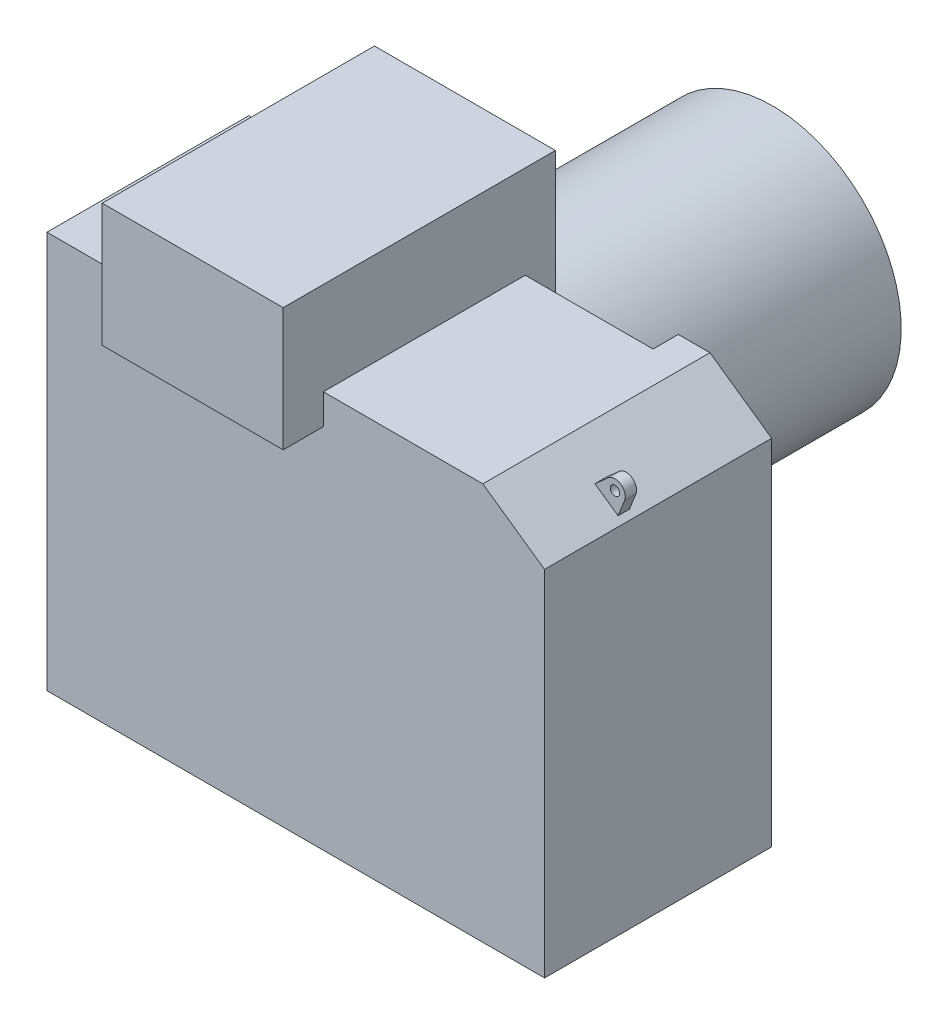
ISO-10303-21;
HEADER;
FILE_DESCRIPTION(('STEP AP214'),'2;1');
FILE_NAME('part.step','',(''),(''),'','','');
FILE_SCHEMA(('AUTOMOTIVE_DESIGN { 1 0 10303 214 1 1 1 1 }'));
ENDSEC;
DATA;
#1=APPLICATION_CONTEXT('core data for automotive mechanical design processes');
#2=APPLICATION_PROTOCOL_DEFINITION('international standard','automotive_design',2000,#1);
#3=PRODUCT_CONTEXT('',#1,'mechanical');
#4=PRODUCT('Part','Part','',(#3));
#5=PRODUCT_RELATED_PRODUCT_CATEGORY('part','',(#4));
#6=PRODUCT_DEFINITION_FORMATION('','',#4);
#7=PRODUCT_DEFINITION_CONTEXT('part definition',#1,'design');
#8=PRODUCT_DEFINITION('design','',#6,#7);
#9=PRODUCT_DEFINITION_SHAPE('','',#8);
#10=(LENGTH_UNIT() NAMED_UNIT(*) SI_UNIT(.MILLI.,.METRE.));
#11=(NAMED_UNIT(*) PLANE_ANGLE_UNIT() SI_UNIT($,.RADIAN.));
#12=(NAMED_UNIT(*) SI_UNIT($,.STERADIAN.) SOLID_ANGLE_UNIT());
#13=UNCERTAINTY_MEASURE_WITH_UNIT(LENGTH_MEASURE(1.E-05),#10,'distance_accuracy_value','');
#14=(GEOMETRIC_REPRESENTATION_CONTEXT(3) GLOBAL_UNCERTAINTY_ASSIGNED_CONTEXT((#13)) GLOBAL_UNIT_ASSIGNED_CONTEXT((#10,
#11,#12)) REPRESENTATION_CONTEXT('',''));
#15=CARTESIAN_POINT('',(0.,0.,0.));
#16=DIRECTION('',(0.,0.,1.));
#17=DIRECTION('',(1.,0.,0.));
#18=AXIS2_PLACEMENT_3D('',#15,#16,#17);
#19=CARTESIAN_POINT('',(-58.7375,115.8875,-25.654));
#20=DIRECTION('',(0.,0.,1.));
#21=DIRECTION('',(1.,0.,0.));
#22=AXIS2_PLACEMENT_3D('',#19,#20,#21);
#23=PLANE('',#22);
#24=CARTESIAN_POINT('',(0.,63.5,-25.654));
#25=DIRECTION('',(0.,0.,-1.));
#26=DIRECTION('',(-1.,0.,0.));
#27=AXIS2_PLACEMENT_3D('',#24,#25,#26);
#28=CIRCLE('',#27,40.64);
#29=CARTESIAN_POINT('',(-17.8450817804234,26.9875,-25.654));
#30=VERTEX_POINT('',#29);
#31=CARTESIAN_POINT('',(17.8450817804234,26.9875,-25.654));
#32=VERTEX_POINT('',#31);
#33=EDGE_CURVE('E54',#30,#32,#28,.T.);
#34=ORIENTED_EDGE('',*,*,#33,.F.);
#35=DIRECTION('',(-1.,0.,0.));
#36=VECTOR('',#35,1.);
#37=CARTESIAN_POINT('',(-58.7375,26.9875,-25.654));
#38=LINE('',#37,#36);
#39=CARTESIAN_POINT('',(-58.7375,26.9875,-25.654));
#40=VERTEX_POINT('',#39);
#41=EDGE_CURVE('E41',#30,#40,#38,.T.);
#42=ORIENTED_EDGE('',*,*,#41,.T.);
#43=DIRECTION('',(0.,-1.,0.));
#44=VECTOR('',#43,1.);
#45=CARTESIAN_POINT('',(-58.7375,115.8875,-25.654));
#46=LINE('',#45,#44);
#47=CARTESIAN_POINT('',(-58.7375,125.4125,-25.654));
#48=VERTEX_POINT('',#47);
#49=EDGE_CURVE('E403',#48,#40,#46,.T.);
#50=ORIENTED_EDGE('',*,*,#49,.F.);
#51=DIRECTION('',(-1.,0.,0.));
#52=VECTOR('',#51,1.);
#53=CARTESIAN_POINT('',(-28.575,125.4125,-25.654));
#54=LINE('',#53,#52);
#55=CARTESIAN_POINT('',(-28.575,125.4125,-25.654));
#56=VERTEX_POINT('',#55);
#57=EDGE_CURVE('E359',#56,#48,#54,.T.);
#58=ORIENTED_EDGE('',*,*,#57,.F.);
#59=DIRECTION('',(0.,-1.,0.));
#60=VECTOR('',#59,1.);
#61=CARTESIAN_POINT('',(-28.575,125.4125,-25.654));
#62=LINE('',#61,#60);
#63=CARTESIAN_POINT('',(-28.575,115.8875,-25.654));
#64=VERTEX_POINT('',#63);
#65=EDGE_CURVE('E378',#56,#64,#62,.T.);
#66=ORIENTED_EDGE('',*,*,#65,.T.);
#67=DIRECTION('',(-1.,0.,0.));
#68=VECTOR('',#67,1.);
#69=CARTESIAN_POINT('',(-58.7375,115.8875,-25.654));
#70=LINE('',#69,#68);
#71=CARTESIAN_POINT('',(28.575,115.8875,-25.654));
#72=VERTEX_POINT('',#71);
#73=EDGE_CURVE('E398',#72,#64,#70,.T.);
#74=ORIENTED_EDGE('',*,*,#73,.F.);
#75=DIRECTION('',(0.,-1.,0.));
#76=VECTOR('',#75,1.);
#77=CARTESIAN_POINT('',(28.575,125.4125,-25.654));
#78=LINE('',#77,#76);
#79=CARTESIAN_POINT('',(28.575,125.4125,-25.654));
#80=VERTEX_POINT('',#79);
#81=EDGE_CURVE('E381',#80,#72,#78,.T.);
#82=ORIENTED_EDGE('',*,*,#81,.F.);
#83=DIRECTION('',(-1.,0.,0.));
#84=VECTOR('',#83,1.);
#85=CARTESIAN_POINT('',(68.9397527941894,125.4125,-25.654));
#86=LINE('',#85,#84);
#87=CARTESIAN_POINT('',(68.9397527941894,125.4125,-25.654));
#88=VERTEX_POINT('',#87);
#89=EDGE_CURVE('E366',#88,#80,#86,.T.);
#90=ORIENTED_EDGE('',*,*,#89,.F.);
#91=DIRECTION('',(0.,-1.,0.));
#92=VECTOR('',#91,1.);
#93=CARTESIAN_POINT('',(68.9397527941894,115.8875,-25.654));
#94=LINE('',#93,#92);
#95=CARTESIAN_POINT('',(68.9397527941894,26.9875,-25.654));
#96=VERTEX_POINT('',#95);
#97=EDGE_CURVE('E531',#88,#96,#94,.T.);
#98=ORIENTED_EDGE('',*,*,#97,.T.);
#99=CARTESIAN_POINT('',(57.15,26.9875,-25.654));
#100=VERTEX_POINT('',#99);
#101=EDGE_CURVE('E399',#96,#100,#38,.T.);
#102=ORIENTED_EDGE('',*,*,#101,.T.);
#103=EDGE_CURVE('E483',#100,#32,#38,.T.);
#104=ORIENTED_EDGE('',*,*,#103,.T.);
#105=EDGE_LOOP('',(#34,#42,#50,#58,#66,#74,#82,#90,#98,#102,#104));
#106=FACE_BOUND('',#105,.T.);
#107=ADVANCED_FACE('F37',(#106),#23,.F.);
#108=CARTESIAN_POINT('',(57.15,26.9875,-38.354));
#109=DIRECTION('',(0.,1.,0.));
#110=DIRECTION('',(0.,0.,1.));
#111=AXIS2_PLACEMENT_3D('',#108,#109,#110);
#112=PLANE('',#111);
#113=ORIENTED_EDGE('',*,*,#41,.F.);
#114=DIRECTION('',(0.,0.,1.));
#115=VECTOR('',#114,1.);
#116=CARTESIAN_POINT('',(-17.8450817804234,26.9875,-132.334));
#117=LINE('',#116,#115);
#118=CARTESIAN_POINT('',(-17.8450817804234,26.9875,-34.13125));
#119=VERTEX_POINT('',#118);
#120=EDGE_CURVE('E246',#30,#119,#117,.F.);
#121=ORIENTED_EDGE('',*,*,#120,.T.);
#122=DIRECTION('',(-1.,0.,0.));
#123=VECTOR('',#122,1.);
#124=CARTESIAN_POINT('',(-58.7375,26.9875,-34.13125));
#125=LINE('',#124,#123);
#126=CARTESIAN_POINT('',(-58.7375,26.9875,-34.13125));
#127=VERTEX_POINT('',#126);
#128=EDGE_CURVE('E233',#119,#127,#125,.T.);
#129=ORIENTED_EDGE('',*,*,#128,.T.);
#130=DIRECTION('',(0.,0.,1.));
#131=VECTOR('',#130,1.);
#132=CARTESIAN_POINT('',(-58.7375,26.9875,38.1));
#133=LINE('',#132,#131);
#134=EDGE_CURVE('E479',#127,#40,#133,.T.);
#135=ORIENTED_EDGE('',*,*,#134,.T.);
#136=EDGE_LOOP('',(#113,#121,#129,#135));
#137=FACE_BOUND('',#136,.T.);
#138=ADVANCED_FACE('F247',(#137),#112,.T.);
#139=CARTESIAN_POINT('',(39.0501582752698,26.9875,-34.13125));
#140=VERTEX_POINT('',#139);
#141=CARTESIAN_POINT('',(17.8450817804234,26.9875,-34.13125));
#142=VERTEX_POINT('',#141);
#143=EDGE_CURVE('E242',#140,#142,#125,.T.);
#144=ORIENTED_EDGE('',*,*,#143,.T.);
#145=DIRECTION('',(0.,0.,1.));
#146=VECTOR('',#145,1.);
#147=CARTESIAN_POINT('',(17.8450817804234,26.9875,-132.334));
#148=LINE('',#147,#146);
#149=EDGE_CURVE('E62',#142,#32,#148,.T.);
#150=ORIENTED_EDGE('',*,*,#149,.T.);
#151=ORIENTED_EDGE('',*,*,#103,.F.);
#152=CARTESIAN_POINT('',(57.15,26.9875,-38.354));
#153=DIRECTION('',(0.,-1.,0.));
#154=DIRECTION('',(0.,0.,1.));
#155=AXIS2_PLACEMENT_3D('',#152,#153,#154);
#156=CIRCLE('',#155,12.7);
#157=CARTESIAN_POINT('',(50.8056186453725,26.9875,-27.3522353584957));
#158=VERTEX_POINT('',#157);
#159=EDGE_CURVE('E502',#100,#158,#156,.T.);
#160=ORIENTED_EDGE('',*,*,#159,.T.);
#161=DIRECTION('',(-0.86628068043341,0.,-0.499557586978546));
#162=VECTOR('',#161,1.);
#163=CARTESIAN_POINT('',(50.8056186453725,26.9875,-27.3522353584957));
#164=LINE('',#163,#162);
#165=EDGE_CURVE('E243',#158,#140,#164,.T.);
#166=ORIENTED_EDGE('',*,*,#165,.T.);
#167=EDGE_LOOP('',(#144,#150,#151,#160,#166));
#168=FACE_BOUND('',#167,.T.);
#169=ADVANCED_FACE('F548',(#168),#112,.T.);
#170=CARTESIAN_POINT('',(-58.7375,26.9875,-34.13125));
#171=DIRECTION('',(0.,0.,1.));
#172=DIRECTION('',(1.,0.,0.));
#173=AXIS2_PLACEMENT_3D('',#170,#171,#172);
#174=PLANE('',#173);
#175=CARTESIAN_POINT('',(0.,63.5,-34.13125));
#176=DIRECTION('',(0.,0.,1.));
#177=DIRECTION('',(1.,0.,0.));
#178=AXIS2_PLACEMENT_3D('',#175,#176,#177);
#179=CIRCLE('',#178,40.64);
#180=EDGE_CURVE('E11',#142,#119,#179,.F.);
#181=ORIENTED_EDGE('',*,*,#180,.F.);
#182=ORIENTED_EDGE('',*,*,#143,.F.);
#183=DIRECTION('',(0.,-1.,0.));
#184=VECTOR('',#183,1.);
#185=CARTESIAN_POINT('',(39.0501582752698,26.9875,-34.13125));
#186=LINE('',#185,#184);
#187=CARTESIAN_POINT('',(39.0501582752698,0.,-34.13125));
#188=VERTEX_POINT('',#187);
#189=EDGE_CURVE('E506',#140,#188,#186,.T.);
#190=ORIENTED_EDGE('',*,*,#189,.T.);
#191=DIRECTION('',(-1.,0.,0.));
#192=VECTOR('',#191,1.);
#193=CARTESIAN_POINT('',(-58.7375,0.,-34.13125));
#194=LINE('',#193,#192);
#195=CARTESIAN_POINT('',(-58.7375,0.,-34.13125));
#196=VERTEX_POINT('',#195);
#197=EDGE_CURVE('E498',#188,#196,#194,.T.);
#198=ORIENTED_EDGE('',*,*,#197,.T.);
#199=DIRECTION('',(0.,-1.,0.));
#200=VECTOR('',#199,1.);
#201=CARTESIAN_POINT('',(-58.7375,26.9875,-34.13125));
#202=LINE('',#201,#200);
#203=EDGE_CURVE('E238',#127,#196,#202,.T.);
#204=ORIENTED_EDGE('',*,*,#203,.F.);
#205=ORIENTED_EDGE('',*,*,#128,.F.);
#206=EDGE_LOOP('',(#181,#182,#190,#198,#204,#205));
#207=FACE_BOUND('',#206,.T.);
#208=ADVANCED_FACE('F235',(#207),#174,.F.);
#209=CARTESIAN_POINT('',(69.0224585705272,132.34788115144,-76.454));
#210=DIRECTION('',(-0.573576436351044,-0.819152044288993,0.));
#211=DIRECTION('',(0.819152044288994,-0.573576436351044,0.));
#212=AXIS2_PLACEMENT_3D('',#209,#210,#211);
#213=PLANE('',#212);
#214=DIRECTION('',(0.,0.,1.));
#215=VECTOR('',#214,1.);
#216=CARTESIAN_POINT('',(78.9272093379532,125.4125,-25.654));
#217=LINE('',#216,#215);
#218=CARTESIAN_POINT('',(78.9272093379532,125.4125,-33.6325882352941));
#219=VERTEX_POINT('',#218);
#220=CARTESIAN_POINT('',(78.9272093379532,125.4125,38.1));
#221=VERTEX_POINT('',#220);
#222=EDGE_CURVE('E302',#219,#221,#217,.T.);
#223=ORIENTED_EDGE('',*,*,#222,.T.);
#224=DIRECTION('',(-0.819152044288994,0.573576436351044,0.));
#225=VECTOR('',#224,1.);
#226=CARTESIAN_POINT('',(138.255046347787,83.8707013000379,38.1));
#227=LINE('',#226,#225);
#228=CARTESIAN_POINT('',(98.425,111.76,38.1));
#229=VERTEX_POINT('',#228);
#230=EDGE_CURVE('E299',#229,#221,#227,.T.);
#231=ORIENTED_EDGE('',*,*,#230,.F.);
#232=DIRECTION('',(0.,0.,1.));
#233=VECTOR('',#232,1.);
#234=CARTESIAN_POINT('',(98.425,111.76,-33.6325882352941));
#235=LINE('',#234,#233);
#236=CARTESIAN_POINT('',(98.425,111.76,-33.6325882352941));
#237=VERTEX_POINT('',#236);
#238=EDGE_CURVE('E296',#237,#229,#235,.T.);
#239=ORIENTED_EDGE('',*,*,#238,.F.);
#240=DIRECTION('',(0.819152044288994,-0.573576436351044,0.));
#241=VECTOR('',#240,1.);
#242=CARTESIAN_POINT('',(118.470148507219,97.7242359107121,-33.6325882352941));
#243=LINE('',#242,#241);
#244=EDGE_CURVE('E47',#219,#237,#243,.T.);
#245=ORIENTED_EDGE('',*,*,#244,.F.);
#246=EDGE_LOOP('',(#223,#231,#239,#245));
#247=FACE_BOUND('',#246,.T.);
#248=DIRECTION('',(0.,0.,-1.));
#249=VECTOR('',#248,1.);
#250=CARTESIAN_POINT('',(89.3229765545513,118.133305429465,13.081));
#251=LINE('',#250,#249);
#252=CARTESIAN_POINT('',(89.3229765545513,118.133305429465,13.081));
#253=VERTEX_POINT('',#252);
#254=CARTESIAN_POINT('',(89.3229765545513,118.133305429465,9.52500000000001));
#255=VERTEX_POINT('',#254);
#256=EDGE_CURVE('E291',#253,#255,#251,.T.);
#257=ORIENTED_EDGE('',*,*,#256,.T.);
#258=DIRECTION('',(0.819152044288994,-0.573576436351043,0.));
#259=VECTOR('',#258,1.);
#260=CARTESIAN_POINT('',(96.6243089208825,113.020857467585,9.525));
#261=LINE('',#260,#259);
#262=CARTESIAN_POINT('',(96.6243089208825,113.020857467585,9.525));
#263=VERTEX_POINT('',#262);
#264=EDGE_CURVE('E283',#255,#263,#261,.T.);
#265=ORIENTED_EDGE('',*,*,#264,.T.);
#266=DIRECTION('',(0.,0.,-1.));
#267=VECTOR('',#266,1.);
#268=CARTESIAN_POINT('',(96.6243089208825,113.020857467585,13.081));
#269=LINE('',#268,#267);
#270=CARTESIAN_POINT('',(96.6243089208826,113.020857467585,13.081));
#271=VERTEX_POINT('',#270);
#272=EDGE_CURVE('E288',#271,#263,#269,.T.);
#273=ORIENTED_EDGE('',*,*,#272,.F.);
#274=DIRECTION('',(0.819152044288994,-0.573576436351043,0.));
#275=VECTOR('',#274,1.);
#276=CARTESIAN_POINT('',(96.6243089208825,113.020857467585,13.081));
#277=LINE('',#276,#275);
#278=EDGE_CURVE('E272',#253,#271,#277,.T.);
#279=ORIENTED_EDGE('',*,*,#278,.F.);
#280=EDGE_LOOP('',(#257,#265,#273,#279));
#281=FACE_BOUND('',#280,.T.);
#282=ADVANCED_FACE('F596',(#247,#281),#213,.F.);
#283=CARTESIAN_POINT('',(-58.7375,26.9875,38.1));
#284=DIRECTION('',(1.,0.,0.));
#285=DIRECTION('',(0.,0.,-1.));
#286=AXIS2_PLACEMENT_3D('',#283,#284,#285);
#287=PLANE('',#286);
#288=DIRECTION('',(0.,0.,1.));
#289=VECTOR('',#288,1.);
#290=CARTESIAN_POINT('',(-58.7375,0.,38.1));
#291=LINE('',#290,#289);
#292=CARTESIAN_POINT('',(-58.7375,0.,38.1));
#293=VERTEX_POINT('',#292);
#294=EDGE_CURVE('E500',#196,#293,#291,.T.);
#295=ORIENTED_EDGE('',*,*,#294,.T.);
#296=DIRECTION('',(0.,-1.,0.));
#297=VECTOR('',#296,1.);
#298=CARTESIAN_POINT('',(-58.7375,26.9875,38.1));
#299=LINE('',#298,#297);
#300=CARTESIAN_POINT('',(-58.7375,125.4125,38.1));
#301=VERTEX_POINT('',#300);
#302=EDGE_CURVE('E482',#301,#293,#299,.T.);
#303=ORIENTED_EDGE('',*,*,#302,.F.);
#304=DIRECTION('',(0.,0.,1.));
#305=VECTOR('',#304,1.);
#306=CARTESIAN_POINT('',(-58.7375,125.4125,-25.654));
#307=LINE('',#306,#305);
#308=EDGE_CURVE('E355',#48,#301,#307,.T.);
#309=ORIENTED_EDGE('',*,*,#308,.F.);
#310=ORIENTED_EDGE('',*,*,#49,.T.);
#311=ORIENTED_EDGE('',*,*,#134,.F.);
#312=ORIENTED_EDGE('',*,*,#203,.T.);
#313=EDGE_LOOP('',(#295,#303,#309,#310,#311,#312));
#314=FACE_BOUND('',#313,.T.);
#315=DIRECTION('',(0.,0.,-1.));
#316=VECTOR('',#315,1.);
#317=CARTESIAN_POINT('',(-58.7375,108.423503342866,11.4935));
#318=LINE('',#317,#316);
#319=CARTESIAN_POINT('',(-58.7375,108.423503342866,11.4935));
#320=VERTEX_POINT('',#319);
#321=CARTESIAN_POINT('',(-58.7375,108.423503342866,7.9375));
#322=VERTEX_POINT('',#321);
#323=EDGE_CURVE('E337',#320,#322,#318,.T.);
#324=ORIENTED_EDGE('',*,*,#323,.T.);
#325=DIRECTION('',(0.,1.,0.));
#326=VECTOR('',#325,1.);
#327=CARTESIAN_POINT('',(-58.7375,120.176496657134,7.9375));
#328=LINE('',#327,#326);
#329=CARTESIAN_POINT('',(-58.7375,120.176496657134,7.9375));
#330=VERTEX_POINT('',#329);
#331=EDGE_CURVE('E329',#322,#330,#328,.T.);
#332=ORIENTED_EDGE('',*,*,#331,.T.);
#333=DIRECTION('',(0.,0.,-1.));
#334=VECTOR('',#333,1.);
#335=CARTESIAN_POINT('',(-58.7375,120.176496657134,11.4935));
#336=LINE('',#335,#334);
#337=CARTESIAN_POINT('',(-58.7375,120.176496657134,11.4935));
#338=VERTEX_POINT('',#337);
#339=EDGE_CURVE('E334',#338,#330,#336,.T.);
#340=ORIENTED_EDGE('',*,*,#339,.F.);
#341=DIRECTION('',(0.,1.,0.));
#342=VECTOR('',#341,1.);
#343=CARTESIAN_POINT('',(-58.7375,120.176496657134,11.4935));
#344=LINE('',#343,#342);
#345=EDGE_CURVE('E318',#320,#338,#344,.T.);
#346=ORIENTED_EDGE('',*,*,#345,.F.);
#347=EDGE_LOOP('',(#324,#332,#340,#346));
#348=FACE_BOUND('',#347,.T.);
#349=ADVANCED_FACE('F525',(#314,#348),#287,.F.);
#350=CARTESIAN_POINT('',(-58.7375,125.4125,-25.654));
#351=DIRECTION('',(0.,1.,0.));
#352=DIRECTION('',(0.,0.,1.));
#353=AXIS2_PLACEMENT_3D('',#350,#351,#352);
#354=PLANE('',#353);
#355=ORIENTED_EDGE('',*,*,#222,.F.);
#356=DIRECTION('',(-1.,0.,0.));
#357=VECTOR('',#356,1.);
#358=CARTESIAN_POINT('',(98.425,125.4125,-33.6325882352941));
#359=LINE('',#358,#357);
#360=CARTESIAN_POINT('',(68.9397527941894,125.4125,-33.6325882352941));
#361=VERTEX_POINT('',#360);
#362=EDGE_CURVE('E360',#219,#361,#359,.T.);
#363=ORIENTED_EDGE('',*,*,#362,.T.);
#364=DIRECTION('',(0.,0.,1.));
#365=VECTOR('',#364,1.);
#366=CARTESIAN_POINT('',(68.9397527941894,125.4125,-33.6325882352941));
#367=LINE('',#366,#365);
#368=EDGE_CURVE('E362',#361,#88,#367,.T.);
#369=ORIENTED_EDGE('',*,*,#368,.T.);
#370=ORIENTED_EDGE('',*,*,#89,.T.);
#371=DIRECTION('',(0.,0.,-1.));
#372=VECTOR('',#371,1.);
#373=CARTESIAN_POINT('',(28.575,125.4125,38.1));
#374=LINE('',#373,#372);
#375=CARTESIAN_POINT('',(28.575,125.4125,38.1));
#376=VERTEX_POINT('',#375);
#377=EDGE_CURVE('E440',#376,#80,#374,.T.);
#378=ORIENTED_EDGE('',*,*,#377,.F.);
#379=DIRECTION('',(1.,0.,0.));
#380=VECTOR('',#379,1.);
#381=CARTESIAN_POINT('',(28.575,125.4125,38.1));
#382=LINE('',#381,#380);
#383=EDGE_CURVE('E363',#376,#221,#382,.T.);
#384=ORIENTED_EDGE('',*,*,#383,.T.);
#385=EDGE_LOOP('',(#355,#363,#369,#370,#378,#384));
#386=FACE_BOUND('',#385,.T.);
#387=ADVANCED_FACE('F595',(#386),#354,.T.);
#388=CARTESIAN_POINT('',(57.15,0.,-38.354));
#389=DIRECTION('',(0.,1.,0.));
#390=DIRECTION('',(0.,0.,1.));
#391=AXIS2_PLACEMENT_3D('',#388,#389,#390);
#392=PLANE('',#391);
#393=DIRECTION('',(1.,0.,0.));
#394=VECTOR('',#393,1.);
#395=CARTESIAN_POINT('',(98.425,0.,38.1));
#396=LINE('',#395,#394);
#397=CARTESIAN_POINT('',(98.425,0.,38.1));
#398=VERTEX_POINT('',#397);
#399=EDGE_CURVE('E487',#293,#398,#396,.T.);
#400=ORIENTED_EDGE('',*,*,#399,.F.);
#401=ORIENTED_EDGE('',*,*,#294,.F.);
#402=ORIENTED_EDGE('',*,*,#197,.F.);
#403=DIRECTION('',(-0.86628068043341,0.,-0.499557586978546));
#404=VECTOR('',#403,1.);
#405=CARTESIAN_POINT('',(50.8056186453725,0.,-27.3522353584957));
#406=LINE('',#405,#404);
#407=CARTESIAN_POINT('',(50.8056186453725,0.,-27.3522353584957));
#408=VERTEX_POINT('',#407);
#409=EDGE_CURVE('E496',#408,#188,#406,.T.);
#410=ORIENTED_EDGE('',*,*,#409,.F.);
#411=CARTESIAN_POINT('',(57.15,0.,-38.354));
#412=DIRECTION('',(0.,-1.,0.));
#413=DIRECTION('',(0.,0.,1.));
#414=AXIS2_PLACEMENT_3D('',#411,#412,#413);
#415=CIRCLE('',#414,12.7);
#416=CARTESIAN_POINT('',(68.9397527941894,0.,-33.6325882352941));
#417=VERTEX_POINT('',#416);
#418=EDGE_CURVE('E494',#417,#408,#415,.T.);
#419=ORIENTED_EDGE('',*,*,#418,.F.);
#420=DIRECTION('',(-1.,0.,0.));
#421=VECTOR('',#420,1.);
#422=CARTESIAN_POINT('',(68.9397527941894,0.,-33.6325882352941));
#423=LINE('',#422,#421);
#424=CARTESIAN_POINT('',(98.425,0.,-33.6325882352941));
#425=VERTEX_POINT('',#424);
#426=EDGE_CURVE('E492',#425,#417,#423,.T.);
#427=ORIENTED_EDGE('',*,*,#426,.F.);
#428=DIRECTION('',(0.,0.,-1.));
#429=VECTOR('',#428,1.);
#430=CARTESIAN_POINT('',(98.425,0.,-33.6325882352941));
#431=LINE('',#430,#429);
#432=EDGE_CURVE('E468',#398,#425,#431,.T.);
#433=ORIENTED_EDGE('',*,*,#432,.F.);
#434=EDGE_LOOP('',(#400,#401,#402,#410,#419,#427,#433));
#435=FACE_BOUND('',#434,.T.);
#436=CARTESIAN_POINT('',(0.,0.,0.));
#437=DIRECTION('',(0.,-1.,0.));
#438=DIRECTION('',(0.,0.,-1.));
#439=AXIS2_PLACEMENT_3D('',#436,#437,#438);
#440=CIRCLE('',#439,2.5527);
#441=CARTESIAN_POINT('',(0.,0.,-2.5527));
#442=VERTEX_POINT('',#441);
#443=EDGE_CURVE('E538',#442,#442,#440,.T.);
#444=ORIENTED_EDGE('',*,*,#443,.F.);
#445=EDGE_LOOP('',(#444));
#446=FACE_BOUND('',#445,.T.);
#447=ADVANCED_FACE('F521',(#435,#446),#392,.F.);
#448=CARTESIAN_POINT('',(98.425,26.9875,38.1));
#449=DIRECTION('',(0.,0.,-1.));
#450=DIRECTION('',(-1.,0.,0.));
#451=AXIS2_PLACEMENT_3D('',#448,#449,#450);
#452=PLANE('',#451);
#453=DIRECTION('',(0.,-1.,0.));
#454=VECTOR('',#453,1.);
#455=CARTESIAN_POINT('',(98.425,26.9875,38.1));
#456=LINE('',#455,#454);
#457=EDGE_CURVE('E470',#229,#398,#456,.T.);
#458=ORIENTED_EDGE('',*,*,#457,.F.);
#459=ORIENTED_EDGE('',*,*,#230,.T.);
#460=ORIENTED_EDGE('',*,*,#383,.F.);
#461=DIRECTION('',(0.,-1.,0.));
#462=VECTOR('',#461,1.);
#463=CARTESIAN_POINT('',(28.575,125.4125,38.1));
#464=LINE('',#463,#462);
#465=CARTESIAN_POINT('',(28.575,115.8875,38.1));
#466=VERTEX_POINT('',#465);
#467=EDGE_CURVE('E386',#376,#466,#464,.T.);
#468=ORIENTED_EDGE('',*,*,#467,.T.);
#469=DIRECTION('',(1.,0.,0.));
#470=VECTOR('',#469,1.);
#471=CARTESIAN_POINT('',(-58.7375,115.8875,38.1));
#472=LINE('',#471,#470);
#473=CARTESIAN_POINT('',(-28.575,115.8875,38.1));
#474=VERTEX_POINT('',#473);
#475=EDGE_CURVE('E395',#474,#466,#472,.T.);
#476=ORIENTED_EDGE('',*,*,#475,.F.);
#477=DIRECTION('',(0.,-1.,0.));
#478=VECTOR('',#477,1.);
#479=CARTESIAN_POINT('',(-28.575,125.4125,38.1));
#480=LINE('',#479,#478);
#481=CARTESIAN_POINT('',(-28.575,125.4125,38.1));
#482=VERTEX_POINT('',#481);
#483=EDGE_CURVE('E389',#482,#474,#480,.T.);
#484=ORIENTED_EDGE('',*,*,#483,.F.);
#485=DIRECTION('',(1.,0.,0.));
#486=VECTOR('',#485,1.);
#487=CARTESIAN_POINT('',(-58.7375,125.4125,38.1));
#488=LINE('',#487,#486);
#489=EDGE_CURVE('E358',#301,#482,#488,.T.);
#490=ORIENTED_EDGE('',*,*,#489,.F.);
#491=ORIENTED_EDGE('',*,*,#302,.T.);
#492=ORIENTED_EDGE('',*,*,#399,.T.);
#493=EDGE_LOOP('',(#458,#459,#460,#468,#476,#484,#490,#491,#492));
#494=FACE_BOUND('',#493,.T.);
#495=ADVANCED_FACE('F39',(#494),#452,.F.);
#496=CARTESIAN_POINT('',(98.425,26.9875,-33.6325882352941));
#497=DIRECTION('',(-1.,0.,0.));
#498=DIRECTION('',(0.,0.,1.));
#499=AXIS2_PLACEMENT_3D('',#496,#497,#498);
#500=PLANE('',#499);
#501=DIRECTION('',(0.,-1.,0.));
#502=VECTOR('',#501,1.);
#503=CARTESIAN_POINT('',(98.425,26.9875,-33.6325882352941));
#504=LINE('',#503,#502);
#505=EDGE_CURVE('E459',#237,#425,#504,.T.);
#506=ORIENTED_EDGE('',*,*,#505,.F.);
#507=ORIENTED_EDGE('',*,*,#238,.T.);
#508=ORIENTED_EDGE('',*,*,#457,.T.);
#509=ORIENTED_EDGE('',*,*,#432,.T.);
#510=EDGE_LOOP('',(#506,#507,#508,#509));
#511=FACE_BOUND('',#510,.T.);
#512=ADVANCED_FACE('F465',(#511),#500,.F.);
#513=CARTESIAN_POINT('',(68.9397527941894,26.9875,-33.6325882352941));
#514=DIRECTION('',(0.,0.,1.));
#515=DIRECTION('',(1.,0.,0.));
#516=AXIS2_PLACEMENT_3D('',#513,#514,#515);
#517=PLANE('',#516);
#518=ORIENTED_EDGE('',*,*,#362,.F.);
#519=ORIENTED_EDGE('',*,*,#244,.T.);
#520=ORIENTED_EDGE('',*,*,#505,.T.);
#521=ORIENTED_EDGE('',*,*,#426,.T.);
#522=DIRECTION('',(0.,-1.,0.));
#523=VECTOR('',#522,1.);
#524=CARTESIAN_POINT('',(68.9397527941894,26.9875,-33.6325882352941));
#525=LINE('',#524,#523);
#526=CARTESIAN_POINT('',(68.9397527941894,26.9875,-33.6325882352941));
#527=VERTEX_POINT('',#526);
#528=EDGE_CURVE('E471',#527,#417,#525,.T.);
#529=ORIENTED_EDGE('',*,*,#528,.F.);
#530=DIRECTION('',(0.,-1.,0.));
#531=VECTOR('',#530,1.);
#532=CARTESIAN_POINT('',(68.9397527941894,115.8875,-33.6325882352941));
#533=LINE('',#532,#531);
#534=EDGE_CURVE('E533',#361,#527,#533,.T.);
#535=ORIENTED_EDGE('',*,*,#534,.F.);
#536=EDGE_LOOP('',(#518,#519,#520,#521,#529,#535));
#537=FACE_BOUND('',#536,.T.);
#538=ADVANCED_FACE('F458',(#537),#517,.F.);
#539=CARTESIAN_POINT('',(57.15,26.9875,-38.354));
#540=DIRECTION('',(0.,-1.,0.));
#541=DIRECTION('',(0.,0.,-1.));
#542=AXIS2_PLACEMENT_3D('',#539,#540,#541);
#543=CYLINDRICAL_SURFACE('',#542,12.7);
#544=ORIENTED_EDGE('',*,*,#418,.T.);
#545=DIRECTION('',(0.,-1.,0.));
#546=VECTOR('',#545,1.);
#547=CARTESIAN_POINT('',(50.8056186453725,26.9875,-27.3522353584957));
#548=LINE('',#547,#546);
#549=EDGE_CURVE('E475',#158,#408,#548,.T.);
#550=ORIENTED_EDGE('',*,*,#549,.F.);
#551=ORIENTED_EDGE('',*,*,#159,.F.);
#552=EDGE_CURVE('E546',#527,#100,#156,.T.);
#553=ORIENTED_EDGE('',*,*,#552,.F.);
#554=ORIENTED_EDGE('',*,*,#528,.T.);
#555=EDGE_LOOP('',(#544,#550,#551,#553,#554));
#556=FACE_BOUND('',#555,.T.);
#557=ADVANCED_FACE('F550',(#556),#543,.F.);
#558=CARTESIAN_POINT('',(50.8056186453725,26.9875,-27.3522353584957));
#559=DIRECTION('',(-0.499557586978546,0.,0.86628068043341));
#560=DIRECTION('',(0.86628068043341,0.,0.499557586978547));
#561=AXIS2_PLACEMENT_3D('',#558,#559,#560);
#562=PLANE('',#561);
#563=ORIENTED_EDGE('',*,*,#409,.T.);
#564=ORIENTED_EDGE('',*,*,#189,.F.);
#565=ORIENTED_EDGE('',*,*,#165,.F.);
#566=ORIENTED_EDGE('',*,*,#549,.T.);
#567=EDGE_LOOP('',(#563,#564,#565,#566));
#568=FACE_BOUND('',#567,.T.);
#569=ADVANCED_FACE('F513',(#568),#562,.F.);
#570=ORIENTED_EDGE('',*,*,#101,.F.);
#571=DIRECTION('',(0.,0.,1.));
#572=VECTOR('',#571,1.);
#573=CARTESIAN_POINT('',(68.9397527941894,26.9875,-33.6325882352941));
#574=LINE('',#573,#572);
#575=EDGE_CURVE('E429',#527,#96,#574,.T.);
#576=ORIENTED_EDGE('',*,*,#575,.F.);
#577=ORIENTED_EDGE('',*,*,#552,.T.);
#578=EDGE_LOOP('',(#570,#576,#577));
#579=FACE_BOUND('',#578,.T.);
#580=ADVANCED_FACE('F552',(#579),#112,.T.);
#581=CARTESIAN_POINT('',(0.,6.604,0.));
#582=DIRECTION('',(0.,-1.,0.));
#583=DIRECTION('',(0.,0.,-1.));
#584=AXIS2_PLACEMENT_3D('',#581,#582,#583);
#585=CONICAL_SURFACE('',#584,2.5527,1.02974425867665);
#586=CARTESIAN_POINT('',(0.,8.13781690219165,0.));
#587=VERTEX_POINT('',#586);
#588=VERTEX_LOOP('',#587);
#589=FACE_BOUND('',#588,.T.);
#590=CARTESIAN_POINT('',(0.,6.604,0.));
#591=DIRECTION('',(0.,-1.,0.));
#592=DIRECTION('',(0.,0.,-1.));
#593=AXIS2_PLACEMENT_3D('',#590,#591,#592);
#594=CIRCLE('',#593,2.5527);
#595=CARTESIAN_POINT('',(0.,6.604,-2.5527));
#596=VERTEX_POINT('',#595);
#597=EDGE_CURVE('E490',#596,#596,#594,.T.);
#598=ORIENTED_EDGE('',*,*,#597,.T.);
#599=EDGE_LOOP('',(#598));
#600=FACE_BOUND('',#599,.T.);
#601=ADVANCED_FACE('F651',(#589,#600),#585,.F.);
#602=CARTESIAN_POINT('',(0.,0.,0.));
#603=DIRECTION('',(0.,-1.,0.));
#604=DIRECTION('',(0.,0.,-1.));
#605=AXIS2_PLACEMENT_3D('',#602,#603,#604);
#606=CYLINDRICAL_SURFACE('',#605,2.5527);
#607=ORIENTED_EDGE('',*,*,#597,.F.);
#608=EDGE_LOOP('',(#607));
#609=FACE_BOUND('',#608,.T.);
#610=ORIENTED_EDGE('',*,*,#443,.T.);
#611=EDGE_LOOP('',(#610));
#612=FACE_BOUND('',#611,.T.);
#613=ADVANCED_FACE('F648',(#609,#612),#606,.F.);
#614=CARTESIAN_POINT('',(68.9397527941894,115.8875,-33.6325882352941));
#615=DIRECTION('',(1.,0.,0.));
#616=DIRECTION('',(0.,0.,-1.));
#617=AXIS2_PLACEMENT_3D('',#614,#615,#616);
#618=PLANE('',#617);
#619=ORIENTED_EDGE('',*,*,#575,.T.);
#620=ORIENTED_EDGE('',*,*,#97,.F.);
#621=ORIENTED_EDGE('',*,*,#368,.F.);
#622=ORIENTED_EDGE('',*,*,#534,.T.);
#623=EDGE_LOOP('',(#619,#620,#621,#622));
#624=FACE_BOUND('',#623,.T.);
#625=ADVANCED_FACE('F556',(#624),#618,.F.);
#626=CARTESIAN_POINT('',(-58.7375,115.8875,-25.654));
#627=DIRECTION('',(0.,1.,0.));
#628=DIRECTION('',(0.,0.,1.));
#629=AXIS2_PLACEMENT_3D('',#626,#627,#628);
#630=PLANE('',#629);
#631=DIRECTION('',(0.,0.,1.));
#632=VECTOR('',#631,1.);
#633=CARTESIAN_POINT('',(-28.575,115.8875,50.8));
#634=LINE('',#633,#632);
#635=CARTESIAN_POINT('',(-28.575,115.8875,50.8));
#636=VERTEX_POINT('',#635);
#637=EDGE_CURVE('E354',#474,#636,#634,.T.);
#638=ORIENTED_EDGE('',*,*,#637,.F.);
#639=ORIENTED_EDGE('',*,*,#475,.T.);
#640=DIRECTION('',(0.,0.,-1.));
#641=VECTOR('',#640,1.);
#642=CARTESIAN_POINT('',(28.575,115.8875,38.1));
#643=LINE('',#642,#641);
#644=CARTESIAN_POINT('',(28.575,115.8875,50.8));
#645=VERTEX_POINT('',#644);
#646=EDGE_CURVE('E369',#645,#466,#643,.T.);
#647=ORIENTED_EDGE('',*,*,#646,.F.);
#648=DIRECTION('',(1.,0.,0.));
#649=VECTOR('',#648,1.);
#650=CARTESIAN_POINT('',(28.575,115.8875,50.8));
#651=LINE('',#650,#649);
#652=EDGE_CURVE('E367',#636,#645,#651,.T.);
#653=ORIENTED_EDGE('',*,*,#652,.F.);
#654=EDGE_LOOP('',(#638,#639,#647,#653));
#655=FACE_BOUND('',#654,.T.);
#656=ADVANCED_FACE('F592',(#655),#630,.F.);
#657=DIRECTION('',(0.,0.,-1.));
#658=VECTOR('',#657,1.);
#659=CARTESIAN_POINT('',(28.575,115.8875,-35.179));
#660=LINE('',#659,#658);
#661=CARTESIAN_POINT('',(28.575,115.8875,-35.179));
#662=VERTEX_POINT('',#661);
#663=EDGE_CURVE('E373',#72,#662,#660,.T.);
#664=ORIENTED_EDGE('',*,*,#663,.F.);
#665=ORIENTED_EDGE('',*,*,#73,.T.);
#666=DIRECTION('',(0.,0.,1.));
#667=VECTOR('',#666,1.);
#668=CARTESIAN_POINT('',(-28.575,115.8875,-25.654));
#669=LINE('',#668,#667);
#670=CARTESIAN_POINT('',(-28.575,115.8875,-35.179));
#671=VERTEX_POINT('',#670);
#672=EDGE_CURVE('E372',#671,#64,#669,.T.);
#673=ORIENTED_EDGE('',*,*,#672,.F.);
#674=DIRECTION('',(-1.,0.,0.));
#675=VECTOR('',#674,1.);
#676=CARTESIAN_POINT('',(-28.575,115.8875,-35.179));
#677=LINE('',#676,#675);
#678=EDGE_CURVE('E370',#662,#671,#677,.T.);
#679=ORIENTED_EDGE('',*,*,#678,.F.);
#680=EDGE_LOOP('',(#664,#665,#673,#679));
#681=FACE_BOUND('',#680,.T.);
#682=ADVANCED_FACE('F579',(#681),#630,.F.);
#683=CARTESIAN_POINT('',(-28.575,125.4125,50.8));
#684=DIRECTION('',(1.,0.,0.));
#685=DIRECTION('',(0.,0.,-1.));
#686=AXIS2_PLACEMENT_3D('',#683,#684,#685);
#687=PLANE('',#686);
#688=ORIENTED_EDGE('',*,*,#637,.T.);
#689=DIRECTION('',(0.,-1.,0.));
#690=VECTOR('',#689,1.);
#691=CARTESIAN_POINT('',(-28.575,125.4125,50.8));
#692=LINE('',#691,#690);
#693=CARTESIAN_POINT('',(-28.575,154.78125,50.8));
#694=VERTEX_POINT('',#693);
#695=EDGE_CURVE('E385',#694,#636,#692,.T.);
#696=ORIENTED_EDGE('',*,*,#695,.F.);
#697=DIRECTION('',(0.,0.,1.));
#698=VECTOR('',#697,1.);
#699=CARTESIAN_POINT('',(-28.575,154.78125,-35.179));
#700=LINE('',#699,#698);
#701=CARTESIAN_POINT('',(-28.575,154.78125,-35.179));
#702=VERTEX_POINT('',#701);
#703=EDGE_CURVE('E345',#702,#694,#700,.T.);
#704=ORIENTED_EDGE('',*,*,#703,.F.);
#705=DIRECTION('',(0.,-1.,0.));
#706=VECTOR('',#705,1.);
#707=CARTESIAN_POINT('',(-28.575,125.4125,-35.179));
#708=LINE('',#707,#706);
#709=EDGE_CURVE('E374',#702,#671,#708,.T.);
#710=ORIENTED_EDGE('',*,*,#709,.T.);
#711=ORIENTED_EDGE('',*,*,#672,.T.);
#712=ORIENTED_EDGE('',*,*,#65,.F.);
#713=DIRECTION('',(0.,0.,1.));
#714=VECTOR('',#713,1.);
#715=CARTESIAN_POINT('',(-28.575,125.4125,38.1));
#716=LINE('',#715,#714);
#717=EDGE_CURVE('E444',#56,#482,#716,.T.);
#718=ORIENTED_EDGE('',*,*,#717,.T.);
#719=ORIENTED_EDGE('',*,*,#483,.T.);
#720=EDGE_LOOP('',(#688,#696,#704,#710,#711,#712,#718,#719));
#721=FACE_BOUND('',#720,.T.);
#722=ADVANCED_FACE('F569',(#721),#687,.F.);
#723=CARTESIAN_POINT('',(28.575,125.4125,50.8));
#724=DIRECTION('',(0.,0.,-1.));
#725=DIRECTION('',(-1.,0.,0.));
#726=AXIS2_PLACEMENT_3D('',#723,#724,#725);
#727=PLANE('',#726);
#728=ORIENTED_EDGE('',*,*,#652,.T.);
#729=DIRECTION('',(0.,-1.,0.));
#730=VECTOR('',#729,1.);
#731=CARTESIAN_POINT('',(28.575,125.4125,50.8));
#732=LINE('',#731,#730);
#733=CARTESIAN_POINT('',(28.575,154.78125,50.8));
#734=VERTEX_POINT('',#733);
#735=EDGE_CURVE('E382',#734,#645,#732,.T.);
#736=ORIENTED_EDGE('',*,*,#735,.F.);
#737=DIRECTION('',(1.,0.,0.));
#738=VECTOR('',#737,1.);
#739=CARTESIAN_POINT('',(-28.575,154.78125,50.8));
#740=LINE('',#739,#738);
#741=EDGE_CURVE('E348',#694,#734,#740,.T.);
#742=ORIENTED_EDGE('',*,*,#741,.F.);
#743=ORIENTED_EDGE('',*,*,#695,.T.);
#744=EDGE_LOOP('',(#728,#736,#742,#743));
#745=FACE_BOUND('',#744,.T.);
#746=ADVANCED_FACE('F826',(#745),#727,.F.);
#747=CARTESIAN_POINT('',(28.575,125.4125,38.1));
#748=DIRECTION('',(-1.,0.,0.));
#749=DIRECTION('',(0.,0.,1.));
#750=AXIS2_PLACEMENT_3D('',#747,#748,#749);
#751=PLANE('',#750);
#752=ORIENTED_EDGE('',*,*,#646,.T.);
#753=ORIENTED_EDGE('',*,*,#467,.F.);
#754=ORIENTED_EDGE('',*,*,#377,.T.);
#755=ORIENTED_EDGE('',*,*,#81,.T.);
#756=ORIENTED_EDGE('',*,*,#663,.T.);
#757=DIRECTION('',(0.,-1.,0.));
#758=VECTOR('',#757,1.);
#759=CARTESIAN_POINT('',(28.575,125.4125,-35.179));
#760=LINE('',#759,#758);
#761=CARTESIAN_POINT('',(28.575,154.78125,-35.179));
#762=VERTEX_POINT('',#761);
#763=EDGE_CURVE('E377',#762,#662,#760,.T.);
#764=ORIENTED_EDGE('',*,*,#763,.F.);
#765=DIRECTION('',(0.,0.,-1.));
#766=VECTOR('',#765,1.);
#767=CARTESIAN_POINT('',(28.575,154.78125,50.8));
#768=LINE('',#767,#766);
#769=EDGE_CURVE('E351',#734,#762,#768,.T.);
#770=ORIENTED_EDGE('',*,*,#769,.F.);
#771=ORIENTED_EDGE('',*,*,#735,.T.);
#772=EDGE_LOOP('',(#752,#753,#754,#755,#756,#764,#770,#771));
#773=FACE_BOUND('',#772,.T.);
#774=ADVANCED_FACE('F576',(#773),#751,.F.);
#775=CARTESIAN_POINT('',(-28.575,125.4125,-35.179));
#776=DIRECTION('',(0.,0.,1.));
#777=DIRECTION('',(1.,0.,0.));
#778=AXIS2_PLACEMENT_3D('',#775,#776,#777);
#779=PLANE('',#778);
#780=ORIENTED_EDGE('',*,*,#678,.T.);
#781=ORIENTED_EDGE('',*,*,#709,.F.);
#782=DIRECTION('',(-1.,0.,0.));
#783=VECTOR('',#782,1.);
#784=CARTESIAN_POINT('',(28.575,154.78125,-35.179));
#785=LINE('',#784,#783);
#786=EDGE_CURVE('E342',#762,#702,#785,.T.);
#787=ORIENTED_EDGE('',*,*,#786,.F.);
#788=ORIENTED_EDGE('',*,*,#763,.T.);
#789=EDGE_LOOP('',(#780,#781,#787,#788));
#790=FACE_BOUND('',#789,.T.);
#791=ADVANCED_FACE('F581',(#790),#779,.F.);
#792=ORIENTED_EDGE('',*,*,#717,.F.);
#793=ORIENTED_EDGE('',*,*,#57,.T.);
#794=ORIENTED_EDGE('',*,*,#308,.T.);
#795=ORIENTED_EDGE('',*,*,#489,.T.);
#796=EDGE_LOOP('',(#792,#793,#794,#795));
#797=FACE_BOUND('',#796,.T.);
#798=ADVANCED_FACE('F562',(#797),#354,.T.);
#799=CARTESIAN_POINT('',(-28.575,154.78125,-35.179));
#800=DIRECTION('',(0.,1.,0.));
#801=DIRECTION('',(0.,0.,1.));
#802=AXIS2_PLACEMENT_3D('',#799,#800,#801);
#803=PLANE('',#802);
#804=ORIENTED_EDGE('',*,*,#786,.T.);
#805=ORIENTED_EDGE('',*,*,#703,.T.);
#806=ORIENTED_EDGE('',*,*,#741,.T.);
#807=ORIENTED_EDGE('',*,*,#769,.T.);
#808=EDGE_LOOP('',(#804,#805,#806,#807));
#809=FACE_BOUND('',#808,.T.);
#810=ADVANCED_FACE('F586',(#809),#803,.T.);
#811=CARTESIAN_POINT('',(-65.0875,114.3,11.4935));
#812=DIRECTION('',(0.,0.,1.));
#813=DIRECTION('',(1.,0.,0.));
#814=AXIS2_PLACEMENT_3D('',#811,#812,#813);
#815=PLANE('',#814);
#816=CARTESIAN_POINT('',(-65.0875,114.3,11.4935));
#817=DIRECTION('',(0.,0.,1.));
#818=DIRECTION('',(1.,0.,0.));
#819=AXIS2_PLACEMENT_3D('',#816,#817,#818);
#820=CIRCLE('',#819,3.26389999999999);
#821=CARTESIAN_POINT('',(-66.236888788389,117.354823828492,11.4935));
#822=VERTEX_POINT('',#821);
#823=CARTESIAN_POINT('',(-66.236888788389,111.245176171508,11.4935));
#824=VERTEX_POINT('',#823);
#825=EDGE_CURVE('E311',#822,#824,#820,.T.);
#826=ORIENTED_EDGE('',*,*,#825,.T.);
#827=DIRECTION('',(0.935942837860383,-0.352151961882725,0.));
#828=VECTOR('',#827,1.);
#829=CARTESIAN_POINT('',(-66.236888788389,111.245176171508,11.4935));
#830=LINE('',#829,#828);
#831=EDGE_CURVE('E314',#824,#320,#830,.T.);
#832=ORIENTED_EDGE('',*,*,#831,.T.);
#833=ORIENTED_EDGE('',*,*,#345,.T.);
#834=DIRECTION('',(-0.935942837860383,-0.352151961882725,0.));
#835=VECTOR('',#834,1.);
#836=CARTESIAN_POINT('',(-66.236888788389,117.354823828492,11.4935));
#837=LINE('',#836,#835);
#838=EDGE_CURVE('E321',#338,#822,#837,.T.);
#839=ORIENTED_EDGE('',*,*,#838,.T.);
#840=EDGE_LOOP('',(#826,#832,#833,#839));
#841=FACE_BOUND('',#840,.T.);
#842=CARTESIAN_POINT('',(-65.0875,114.3,11.4935));
#843=DIRECTION('',(0.,0.,1.));
#844=DIRECTION('',(1.,0.,0.));
#845=AXIS2_PLACEMENT_3D('',#842,#843,#844);
#846=CIRCLE('',#845,1.4859);
#847=CARTESIAN_POINT('',(-63.6016,114.3,11.4935));
#848=VERTEX_POINT('',#847);
#849=EDGE_CURVE('E305',#848,#848,#846,.T.);
#850=ORIENTED_EDGE('',*,*,#849,.F.);
#851=EDGE_LOOP('',(#850));
#852=FACE_BOUND('',#851,.T.);
#853=ADVANCED_FACE('F796',(#841,#852),#815,.T.);
#854=CARTESIAN_POINT('',(-65.0875,114.3,7.9375));
#855=DIRECTION('',(0.,0.,1.));
#856=DIRECTION('',(1.,0.,0.));
#857=AXIS2_PLACEMENT_3D('',#854,#855,#856);
#858=PLANE('',#857);
#859=CARTESIAN_POINT('',(-65.0875,114.3,7.9375));
#860=DIRECTION('',(0.,0.,1.));
#861=DIRECTION('',(1.,0.,0.));
#862=AXIS2_PLACEMENT_3D('',#859,#860,#861);
#863=CIRCLE('',#862,3.26389999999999);
#864=CARTESIAN_POINT('',(-66.236888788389,117.354823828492,7.9375));
#865=VERTEX_POINT('',#864);
#866=CARTESIAN_POINT('',(-66.236888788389,111.245176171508,7.9375));
#867=VERTEX_POINT('',#866);
#868=EDGE_CURVE('E308',#865,#867,#863,.T.);
#869=ORIENTED_EDGE('',*,*,#868,.F.);
#870=DIRECTION('',(-0.935942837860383,-0.352151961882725,0.));
#871=VECTOR('',#870,1.);
#872=CARTESIAN_POINT('',(-66.236888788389,117.354823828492,7.9375));
#873=LINE('',#872,#871);
#874=EDGE_CURVE('E315',#330,#865,#873,.T.);
#875=ORIENTED_EDGE('',*,*,#874,.F.);
#876=ORIENTED_EDGE('',*,*,#331,.F.);
#877=DIRECTION('',(0.935942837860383,-0.352151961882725,0.));
#878=VECTOR('',#877,1.);
#879=CARTESIAN_POINT('',(-66.236888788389,111.245176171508,7.9375));
#880=LINE('',#879,#878);
#881=EDGE_CURVE('E326',#867,#322,#880,.T.);
#882=ORIENTED_EDGE('',*,*,#881,.F.);
#883=EDGE_LOOP('',(#869,#875,#876,#882));
#884=FACE_BOUND('',#883,.T.);
#885=CARTESIAN_POINT('',(-65.0875,114.3,7.9375));
#886=DIRECTION('',(0.,0.,1.));
#887=DIRECTION('',(1.,0.,0.));
#888=AXIS2_PLACEMENT_3D('',#885,#886,#887);
#889=CIRCLE('',#888,1.4859);
#890=CARTESIAN_POINT('',(-63.6016,114.3,7.9375));
#891=VERTEX_POINT('',#890);
#892=EDGE_CURVE('E304',#891,#891,#889,.T.);
#893=ORIENTED_EDGE('',*,*,#892,.T.);
#894=EDGE_LOOP('',(#893));
#895=FACE_BOUND('',#894,.T.);
#896=ADVANCED_FACE('F788',(#884,#895),#858,.F.);
#897=CARTESIAN_POINT('',(-65.0875,114.3,11.4935));
#898=DIRECTION('',(0.,0.,-1.));
#899=DIRECTION('',(-1.,0.,0.));
#900=AXIS2_PLACEMENT_3D('',#897,#898,#899);
#901=CYLINDRICAL_SURFACE('',#900,3.26389999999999);
#902=ORIENTED_EDGE('',*,*,#868,.T.);
#903=DIRECTION('',(0.,0.,-1.));
#904=VECTOR('',#903,1.);
#905=CARTESIAN_POINT('',(-66.236888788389,111.245176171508,11.4935));
#906=LINE('',#905,#904);
#907=EDGE_CURVE('E339',#824,#867,#906,.T.);
#908=ORIENTED_EDGE('',*,*,#907,.F.);
#909=ORIENTED_EDGE('',*,*,#825,.F.);
#910=DIRECTION('',(0.,0.,-1.));
#911=VECTOR('',#910,1.);
#912=CARTESIAN_POINT('',(-66.236888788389,117.354823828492,11.4935));
#913=LINE('',#912,#911);
#914=EDGE_CURVE('E323',#822,#865,#913,.T.);
#915=ORIENTED_EDGE('',*,*,#914,.T.);
#916=EDGE_LOOP('',(#902,#908,#909,#915));
#917=FACE_BOUND('',#916,.T.);
#918=ADVANCED_FACE('F780',(#917),#901,.T.);
#919=CARTESIAN_POINT('',(-66.236888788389,111.245176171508,11.4935));
#920=DIRECTION('',(0.352151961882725,0.935942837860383,0.));
#921=DIRECTION('',(-0.935942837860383,0.352151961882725,0.));
#922=AXIS2_PLACEMENT_3D('',#919,#920,#921);
#923=PLANE('',#922);
#924=ORIENTED_EDGE('',*,*,#881,.T.);
#925=ORIENTED_EDGE('',*,*,#323,.F.);
#926=ORIENTED_EDGE('',*,*,#831,.F.);
#927=ORIENTED_EDGE('',*,*,#907,.T.);
#928=EDGE_LOOP('',(#924,#925,#926,#927));
#929=FACE_BOUND('',#928,.T.);
#930=ADVANCED_FACE('F772',(#929),#923,.F.);
#931=CARTESIAN_POINT('',(-66.236888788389,117.354823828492,11.4935));
#932=DIRECTION('',(0.352151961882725,-0.935942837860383,0.));
#933=DIRECTION('',(0.935942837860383,0.352151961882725,0.));
#934=AXIS2_PLACEMENT_3D('',#931,#932,#933);
#935=PLANE('',#934);
#936=ORIENTED_EDGE('',*,*,#874,.T.);
#937=ORIENTED_EDGE('',*,*,#914,.F.);
#938=ORIENTED_EDGE('',*,*,#838,.F.);
#939=ORIENTED_EDGE('',*,*,#339,.T.);
#940=EDGE_LOOP('',(#936,#937,#938,#939));
#941=FACE_BOUND('',#940,.T.);
#942=ADVANCED_FACE('F764',(#941),#935,.F.);
#943=CARTESIAN_POINT('',(-65.0875,114.3,11.4935));
#944=DIRECTION('',(0.,0.,-1.));
#945=DIRECTION('',(-1.,0.,0.));
#946=AXIS2_PLACEMENT_3D('',#943,#944,#945);
#947=CYLINDRICAL_SURFACE('',#946,1.4859);
#948=ORIENTED_EDGE('',*,*,#849,.T.);
#949=EDGE_LOOP('',(#948));
#950=FACE_BOUND('',#949,.T.);
#951=ORIENTED_EDGE('',*,*,#892,.F.);
#952=EDGE_LOOP('',(#951));
#953=FACE_BOUND('',#952,.T.);
#954=ADVANCED_FACE('F621',(#950,#953),#947,.F.);
#955=CARTESIAN_POINT('',(95.646875,119.394852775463,13.081));
#956=DIRECTION('',(0.,0.,1.));
#957=DIRECTION('',(1.,0.,0.));
#958=AXIS2_PLACEMENT_3D('',#955,#956,#957);
#959=PLANE('',#958);
#960=CARTESIAN_POINT('',(95.646875,119.394852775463,13.081));
#961=DIRECTION('',(0.,0.,1.));
#962=DIRECTION('',(1.,0.,0.));
#963=AXIS2_PLACEMENT_3D('',#960,#961,#962);
#964=CIRCLE('',#963,3.26389999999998);
#965=CARTESIAN_POINT('',(98.6796942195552,118.188597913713,13.081));
#966=VERTEX_POINT('',#965);
#967=CARTESIAN_POINT('',(93.4760809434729,121.832207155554,13.081));
#968=VERTEX_POINT('',#967);
#969=EDGE_CURVE('E265',#966,#968,#964,.T.);
#970=ORIENTED_EDGE('',*,*,#969,.T.);
#971=DIRECTION('',(-0.746761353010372,-0.665092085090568,0.));
#972=VECTOR('',#971,1.);
#973=CARTESIAN_POINT('',(93.4760809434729,121.832207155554,13.081));
#974=LINE('',#973,#972);
#975=EDGE_CURVE('E268',#968,#253,#974,.T.);
#976=ORIENTED_EDGE('',*,*,#975,.T.);
#977=ORIENTED_EDGE('',*,*,#278,.T.);
#978=DIRECTION('',(0.369574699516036,0.929201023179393,0.));
#979=VECTOR('',#978,1.);
#980=CARTESIAN_POINT('',(98.6796942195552,118.188597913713,13.081));
#981=LINE('',#980,#979);
#982=EDGE_CURVE('E275',#271,#966,#981,.T.);
#983=ORIENTED_EDGE('',*,*,#982,.T.);
#984=EDGE_LOOP('',(#970,#976,#977,#983));
#985=FACE_BOUND('',#984,.T.);
#986=CARTESIAN_POINT('',(95.646875,119.394852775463,13.081));
#987=DIRECTION('',(0.,0.,1.));
#988=DIRECTION('',(1.,0.,0.));
#989=AXIS2_PLACEMENT_3D('',#986,#987,#988);
#990=CIRCLE('',#989,1.4859);
#991=CARTESIAN_POINT('',(97.132775,119.394852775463,13.081));
#992=VERTEX_POINT('',#991);
#993=EDGE_CURVE('E259',#992,#992,#990,.T.);
#994=ORIENTED_EDGE('',*,*,#993,.F.);
#995=EDGE_LOOP('',(#994));
#996=FACE_BOUND('',#995,.T.);
#997=ADVANCED_FACE('F618',(#985,#996),#959,.T.);
#998=CARTESIAN_POINT('',(95.646875,119.394852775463,9.525));
#999=DIRECTION('',(0.,0.,1.));
#1000=DIRECTION('',(1.,0.,0.));
#1001=AXIS2_PLACEMENT_3D('',#998,#999,#1000);
#1002=PLANE('',#1001);
#1003=CARTESIAN_POINT('',(95.646875,119.394852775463,9.525));
#1004=DIRECTION('',(0.,0.,1.));
#1005=DIRECTION('',(1.,0.,0.));
#1006=AXIS2_PLACEMENT_3D('',#1003,#1004,#1005);
#1007=CIRCLE('',#1006,3.26389999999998);
#1008=CARTESIAN_POINT('',(98.6796942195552,118.188597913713,9.525));
#1009=VERTEX_POINT('',#1008);
#1010=CARTESIAN_POINT('',(93.4760809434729,121.832207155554,9.525));
#1011=VERTEX_POINT('',#1010);
#1012=EDGE_CURVE('E262',#1009,#1011,#1007,.T.);
#1013=ORIENTED_EDGE('',*,*,#1012,.F.);
#1014=DIRECTION('',(0.369574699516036,0.929201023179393,0.));
#1015=VECTOR('',#1014,1.);
#1016=CARTESIAN_POINT('',(98.6796942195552,118.188597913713,9.525));
#1017=LINE('',#1016,#1015);
#1018=EDGE_CURVE('E269',#263,#1009,#1017,.T.);
#1019=ORIENTED_EDGE('',*,*,#1018,.F.);
#1020=ORIENTED_EDGE('',*,*,#264,.F.);
#1021=DIRECTION('',(-0.746761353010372,-0.665092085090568,0.));
#1022=VECTOR('',#1021,1.);
#1023=CARTESIAN_POINT('',(93.4760809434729,121.832207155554,9.525));
#1024=LINE('',#1023,#1022);
#1025=EDGE_CURVE('E280',#1011,#255,#1024,.T.);
#1026=ORIENTED_EDGE('',*,*,#1025,.F.);
#1027=EDGE_LOOP('',(#1013,#1019,#1020,#1026));
#1028=FACE_BOUND('',#1027,.T.);
#1029=CARTESIAN_POINT('',(95.646875,119.394852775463,9.525));
#1030=DIRECTION('',(0.,0.,1.));
#1031=DIRECTION('',(1.,0.,0.));
#1032=AXIS2_PLACEMENT_3D('',#1029,#1030,#1031);
#1033=CIRCLE('',#1032,1.4859);
#1034=CARTESIAN_POINT('',(97.132775,119.394852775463,9.525));
#1035=VERTEX_POINT('',#1034);
#1036=EDGE_CURVE('E249',#1035,#1035,#1033,.T.);
#1037=ORIENTED_EDGE('',*,*,#1036,.T.);
#1038=EDGE_LOOP('',(#1037));
#1039=FACE_BOUND('',#1038,.T.);
#1040=ADVANCED_FACE('F608',(#1028,#1039),#1002,.F.);
#1041=CARTESIAN_POINT('',(95.646875,119.394852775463,13.081));
#1042=DIRECTION('',(0.,0.,-1.));
#1043=DIRECTION('',(-1.,0.,0.));
#1044=AXIS2_PLACEMENT_3D('',#1041,#1042,#1043);
#1045=CYLINDRICAL_SURFACE('',#1044,3.26389999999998);
#1046=ORIENTED_EDGE('',*,*,#1012,.T.);
#1047=DIRECTION('',(0.,0.,-1.));
#1048=VECTOR('',#1047,1.);
#1049=CARTESIAN_POINT('',(93.4760809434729,121.832207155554,13.081));
#1050=LINE('',#1049,#1048);
#1051=EDGE_CURVE('E293',#968,#1011,#1050,.T.);
#1052=ORIENTED_EDGE('',*,*,#1051,.F.);
#1053=ORIENTED_EDGE('',*,*,#969,.F.);
#1054=DIRECTION('',(0.,0.,-1.));
#1055=VECTOR('',#1054,1.);
#1056=CARTESIAN_POINT('',(98.6796942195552,118.188597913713,13.081));
#1057=LINE('',#1056,#1055);
#1058=EDGE_CURVE('E277',#966,#1009,#1057,.T.);
#1059=ORIENTED_EDGE('',*,*,#1058,.T.);
#1060=EDGE_LOOP('',(#1046,#1052,#1053,#1059));
#1061=FACE_BOUND('',#1060,.T.);
#1062=ADVANCED_FACE('F616',(#1061),#1045,.T.);
#1063=CARTESIAN_POINT('',(93.4760809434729,121.832207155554,13.081));
#1064=DIRECTION('',(0.665092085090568,-0.746761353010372,0.));
#1065=DIRECTION('',(0.746761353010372,0.665092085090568,0.));
#1066=AXIS2_PLACEMENT_3D('',#1063,#1064,#1065);
#1067=PLANE('',#1066);
#1068=ORIENTED_EDGE('',*,*,#1025,.T.);
#1069=ORIENTED_EDGE('',*,*,#256,.F.);
#1070=ORIENTED_EDGE('',*,*,#975,.F.);
#1071=ORIENTED_EDGE('',*,*,#1051,.T.);
#1072=EDGE_LOOP('',(#1068,#1069,#1070,#1071));
#1073=FACE_BOUND('',#1072,.T.);
#1074=ADVANCED_FACE('F603',(#1073),#1067,.F.);
#1075=CARTESIAN_POINT('',(98.6796942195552,118.188597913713,13.081));
#1076=DIRECTION('',(-0.929201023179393,0.369574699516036,0.));
#1077=DIRECTION('',(-0.369574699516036,-0.929201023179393,0.));
#1078=AXIS2_PLACEMENT_3D('',#1075,#1076,#1077);
#1079=PLANE('',#1078);
#1080=ORIENTED_EDGE('',*,*,#1018,.T.);
#1081=ORIENTED_EDGE('',*,*,#1058,.F.);
#1082=ORIENTED_EDGE('',*,*,#982,.F.);
#1083=ORIENTED_EDGE('',*,*,#272,.T.);
#1084=EDGE_LOOP('',(#1080,#1081,#1082,#1083));
#1085=FACE_BOUND('',#1084,.T.);
#1086=ADVANCED_FACE('F612',(#1085),#1079,.F.);
#1087=CARTESIAN_POINT('',(95.646875,119.394852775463,13.081));
#1088=DIRECTION('',(0.,0.,-1.));
#1089=DIRECTION('',(-1.,0.,0.));
#1090=AXIS2_PLACEMENT_3D('',#1087,#1088,#1089);
#1091=CYLINDRICAL_SURFACE('',#1090,1.4859);
#1092=ORIENTED_EDGE('',*,*,#993,.T.);
#1093=EDGE_LOOP('',(#1092));
#1094=FACE_BOUND('',#1093,.T.);
#1095=ORIENTED_EDGE('',*,*,#1036,.F.);
#1096=EDGE_LOOP('',(#1095));
#1097=FACE_BOUND('',#1096,.T.);
#1098=ADVANCED_FACE('F625',(#1094,#1097),#1091,.F.);
#1099=CARTESIAN_POINT('',(0.,63.5,-132.334));
#1100=DIRECTION('',(0.,0.,1.));
#1101=DIRECTION('',(1.,0.,0.));
#1102=AXIS2_PLACEMENT_3D('',#1099,#1100,#1101);
#1103=CYLINDRICAL_SURFACE('',#1102,40.64);
#1104=ORIENTED_EDGE('',*,*,#120,.F.);
#1105=ORIENTED_EDGE('',*,*,#33,.T.);
#1106=ORIENTED_EDGE('',*,*,#149,.F.);
#1107=ORIENTED_EDGE('',*,*,#180,.T.);
#1108=EDGE_LOOP('',(#1104,#1105,#1106,#1107));
#1109=FACE_BOUND('',#1108,.T.);
#1110=CARTESIAN_POINT('',(0.,63.5,-132.334));
#1111=DIRECTION('',(0.,0.,-1.));
#1112=DIRECTION('',(-1.,0.,0.));
#1113=AXIS2_PLACEMENT_3D('',#1110,#1111,#1112);
#1114=CIRCLE('',#1113,40.64);
#1115=CARTESIAN_POINT('',(-40.64,63.5,-132.334));
#1116=VERTEX_POINT('',#1115);
#1117=EDGE_CURVE('E253',#1116,#1116,#1114,.T.);
#1118=ORIENTED_EDGE('',*,*,#1117,.F.);
#1119=EDGE_LOOP('',(#1118));
#1120=FACE_BOUND('',#1119,.T.);
#1121=ADVANCED_FACE('F251',(#1109,#1120),#1103,.T.);
#1122=CARTESIAN_POINT('',(0.,63.5,-132.334));
#1123=DIRECTION('',(0.,0.,-1.));
#1124=DIRECTION('',(-1.,0.,0.));
#1125=AXIS2_PLACEMENT_3D('',#1122,#1123,#1124);
#1126=PLANE('',#1125);
#1127=ORIENTED_EDGE('',*,*,#1117,.T.);
#1128=EDGE_LOOP('',(#1127));
#1129=FACE_BOUND('',#1128,.T.);
#1130=ADVANCED_FACE('F1014',(#1129),#1126,.T.);
#1131=CLOSED_SHELL('',(#107,#138,#169,#208,#282,#349,#387,#447,#495,#512,#538,#557,#569,#580,
#601,#613,#625,#656,#682,#722,#746,#774,#791,#798,#810,#853,#896,#918,#930,#942,#954,#997,#1040,
#1062,#1074,#1086,#1098,#1121,#1130));
#1132=MANIFOLD_SOLID_BREP('B2',#1131);
#1133=ADVANCED_BREP_SHAPE_REPRESENTATION('',(#18,#1132),#14);
#1134=SHAPE_DEFINITION_REPRESENTATION(#9,#1133);
ENDSEC;
END-ISO-10303-21;
